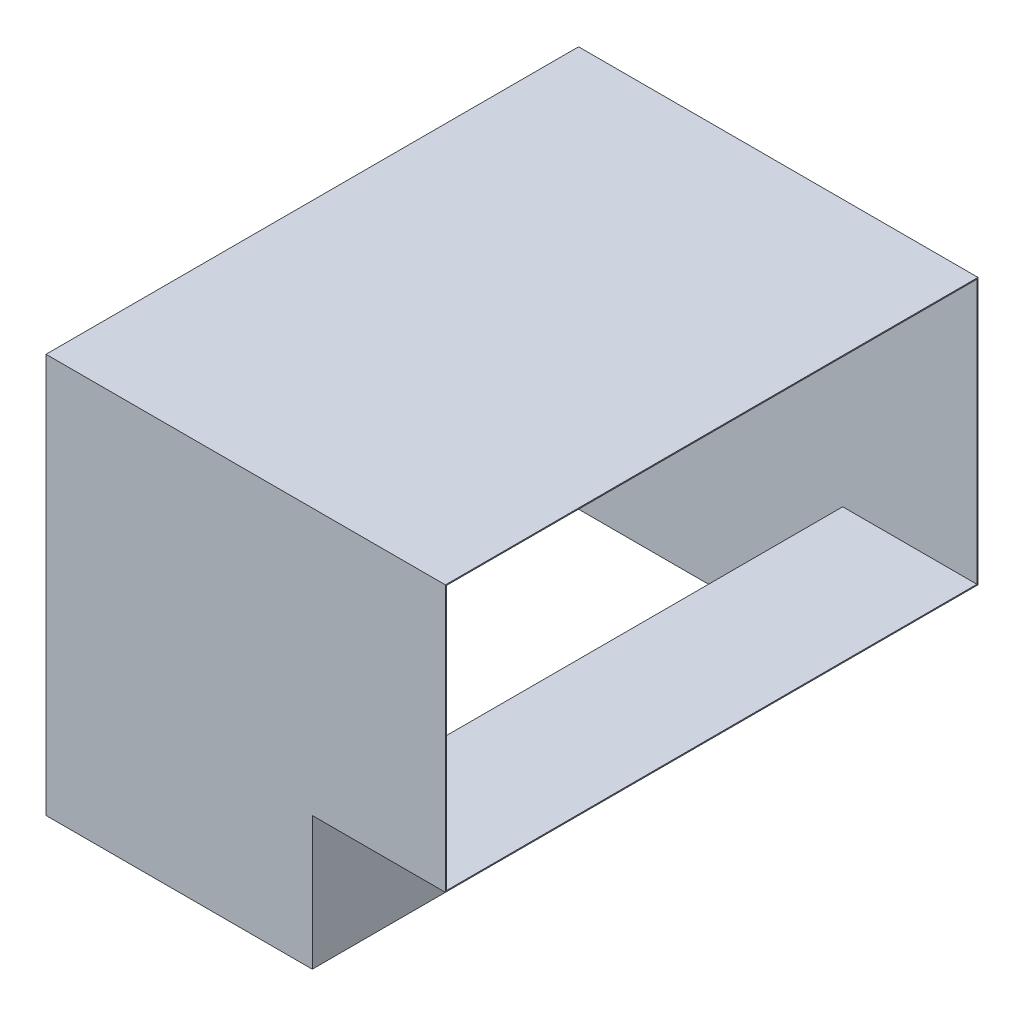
from build123d import *

# Parameters (mm, degrees)
EXTRUDE_THIN1_DEPTH      = 500
EXTRUDE_THIN1_DEPTH_BACK = 250
SKETCH1_W                = 1000
SKETCH1_H                = 500
SKETCH1_W_2              = 996
SKETCH1_H_2              = 496
EXTRUDE_THIN2_START      = -498
SKETCH2_W                = 500
SKETCH2_H                = 1000
SKETCH2_W_2              = 496
SKETCH2_H_2              = 996
EXTRUDE_THIN2_DEPTH      = 748
CUT_EXTRUDE1_REACH       = 1032.776
SKETCH3_W                = 496
SKETCH3_H                = 996
CUT_EXTRUDE2_REACH       = 1032.776
SKETCH4_W                = 996
SKETCH4_H                = 496


with BuildPart() as part:
    # Sketch1 → Extrude-Thin1 (new, two sides: drawn at the far end of the back side and taken through both)
    with BuildSketch(Plane(origin=(0, 0, 0), x_dir=(0, 0, -1), z_dir=(1, 0, 0)).offset(-EXTRUDE_THIN1_DEPTH_BACK)):
        Rectangle(SKETCH1_W, SKETCH1_H)
        Rectangle(SKETCH1_W_2, SKETCH1_H_2, mode=Mode.SUBTRACT)
    extrude(amount=EXTRUDE_THIN1_DEPTH + EXTRUDE_THIN1_DEPTH_BACK)

    # Sketch2 → Extrude-Thin2 (add)
    with BuildSketch(Plane.XZ.offset(250).offset(EXTRUDE_THIN2_START)):
        Rectangle(SKETCH2_W, SKETCH2_H)
        Rectangle(SKETCH2_W_2, SKETCH2_H_2, mode=Mode.SUBTRACT)
    extrude(amount=EXTRUDE_THIN2_DEPTH)

    # Sketch3 → Cut-Extrude1 (cut, up to next)
    with BuildSketch(Plane.XZ.offset(500), mode=Mode.PRIVATE) as cut_extrude1_sk1:
        Rectangle(SKETCH3_W, SKETCH3_H)
    cut_extrude1_tool1 = extrude(cut_extrude1_sk1.sketch, amount=-CUT_EXTRUDE1_REACH, mode=Mode.PRIVATE) & part.part
    add(cut_extrude1_tool1.solids().sort_by_distance((0, -500, 0))[0], mode=Mode.SUBTRACT)

    # Sketch4 → Cut-Extrude2 (cut, up to next)
    with BuildSketch(Plane(origin=(500, 0, 0), x_dir=(0, 0, -1), z_dir=(1, 0, 0)), mode=Mode.PRIVATE) as cut_extrude2_sk1:
        Rectangle(SKETCH4_W, SKETCH4_H)
    cut_extrude2_tool1 = extrude(cut_extrude2_sk1.sketch, amount=-CUT_EXTRUDE2_REACH, mode=Mode.PRIVATE) & part.part
    add(cut_extrude2_tool1.solids().sort_by_distance((500, 0, 0))[0], mode=Mode.SUBTRACT)


solid = part.part
